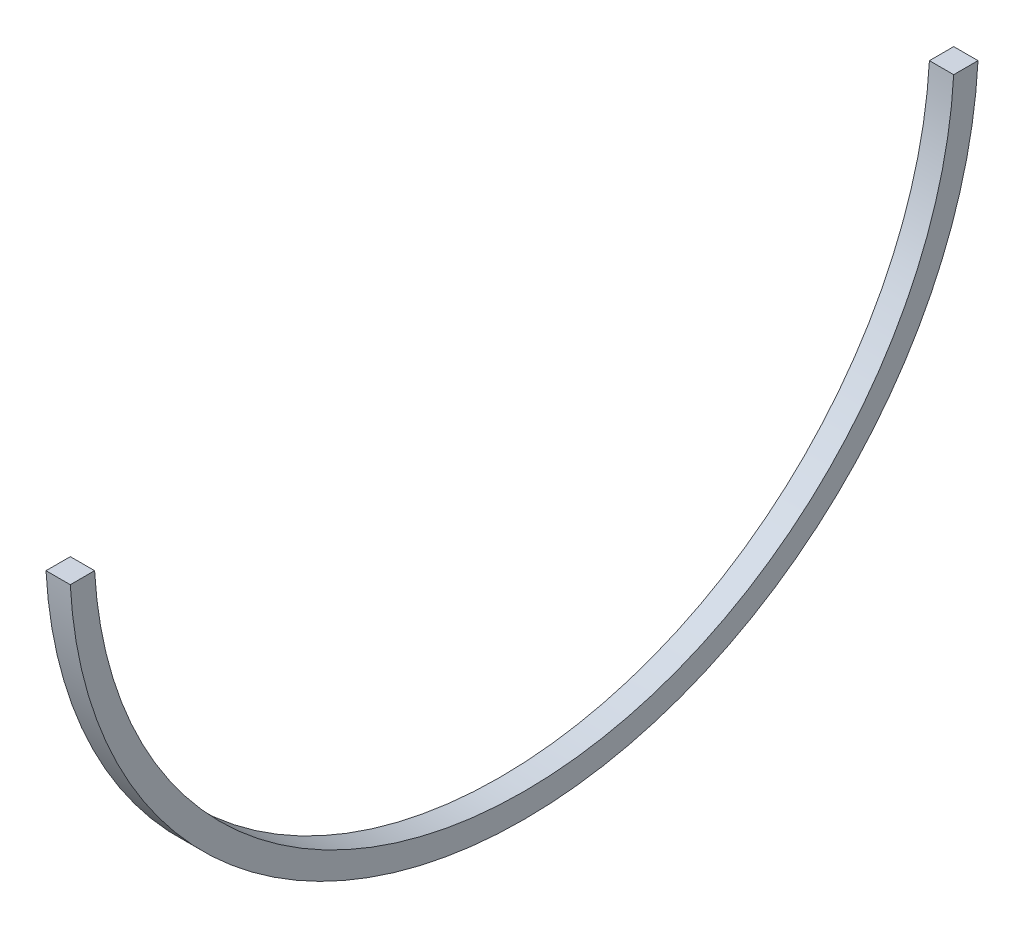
from build123d import *

# Parameters (mm, degrees)
BOSS_EXTRU_1_DEPTH = 5


with BuildPart() as part:
    # Esquisse1 → Boss.-Extru.1 (new body)
    with BuildSketch(Plane(origin=(828, 0, 0), x_dir=(0, 0, -1), z_dir=(1, 0, 0))):
        with BuildLine():
            Line((-88.458803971, -5), (-93.466357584, -5))
            ThreePointArc((-93.466357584, -5), (0, -93.6), (93.466357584, -5))
            Line((93.466357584, -5), (88.458803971, -5))
            ThreePointArc((88.458803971, -5), (0, -88.6), (-88.458803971, -5))
        make_face()
    extrude(amount=BOSS_EXTRU_1_DEPTH)


solid = part.part
